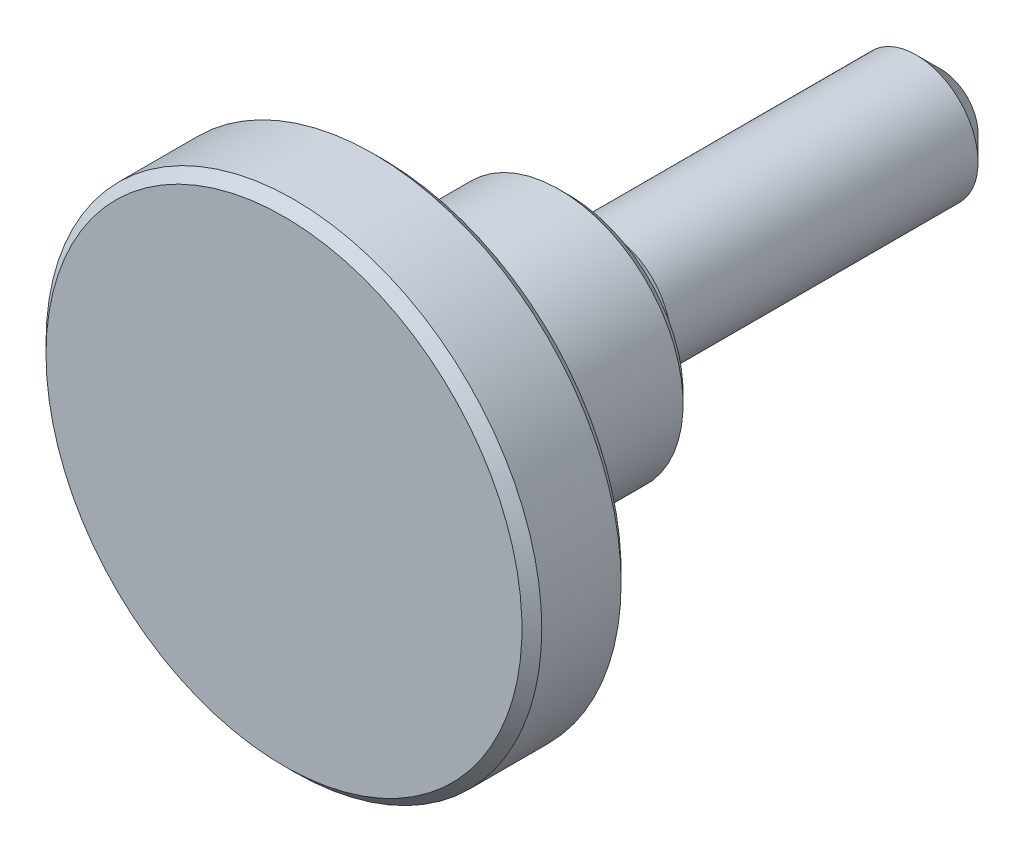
ISO-10303-21;
HEADER;
FILE_DESCRIPTION(('STEP AP214'),'2;1');
FILE_NAME('part.step','',(''),(''),'','','');
FILE_SCHEMA(('AUTOMOTIVE_DESIGN { 1 0 10303 214 1 1 1 1 }'));
ENDSEC;
DATA;
#1=APPLICATION_CONTEXT('core data for automotive mechanical design processes');
#2=APPLICATION_PROTOCOL_DEFINITION('international standard','automotive_design',2000,#1);
#3=PRODUCT_CONTEXT('',#1,'mechanical');
#4=PRODUCT('Part','Part','',(#3));
#5=PRODUCT_RELATED_PRODUCT_CATEGORY('part','',(#4));
#6=PRODUCT_DEFINITION_FORMATION('','',#4);
#7=PRODUCT_DEFINITION_CONTEXT('part definition',#1,'design');
#8=PRODUCT_DEFINITION('design','',#6,#7);
#9=PRODUCT_DEFINITION_SHAPE('','',#8);
#10=(LENGTH_UNIT() NAMED_UNIT(*) SI_UNIT(.MILLI.,.METRE.));
#11=(NAMED_UNIT(*) PLANE_ANGLE_UNIT() SI_UNIT($,.RADIAN.));
#12=(NAMED_UNIT(*) SI_UNIT($,.STERADIAN.) SOLID_ANGLE_UNIT());
#13=UNCERTAINTY_MEASURE_WITH_UNIT(LENGTH_MEASURE(1.E-05),#10,'distance_accuracy_value','');
#14=(GEOMETRIC_REPRESENTATION_CONTEXT(3) GLOBAL_UNCERTAINTY_ASSIGNED_CONTEXT((#13)) GLOBAL_UNIT_ASSIGNED_CONTEXT((#10,
#11,#12)) REPRESENTATION_CONTEXT('',''));
#15=CARTESIAN_POINT('',(0.,0.,0.));
#16=DIRECTION('',(0.,0.,1.));
#17=DIRECTION('',(1.,0.,0.));
#18=AXIS2_PLACEMENT_3D('',#15,#16,#17);
#19=CARTESIAN_POINT('',(0.,1.5,-15.));
#20=DIRECTION('',(0.,0.,-1.));
#21=DIRECTION('',(-1.,0.,0.));
#22=AXIS2_PLACEMENT_3D('',#19,#20,#21);
#23=PLANE('',#22);
#24=CARTESIAN_POINT('',(0.,0.,-15.));
#25=DIRECTION('',(0.,0.,-1.));
#26=DIRECTION('',(-1.,0.,0.));
#27=AXIS2_PLACEMENT_3D('',#24,#25,#26);
#28=CIRCLE('',#27,1.5);
#29=CARTESIAN_POINT('',(-1.5,0.,-15.));
#30=VERTEX_POINT('',#29);
#31=EDGE_CURVE('E8',#30,#30,#28,.T.);
#32=ORIENTED_EDGE('',*,*,#31,.T.);
#33=EDGE_LOOP('',(#32));
#34=FACE_BOUND('',#33,.T.);
#35=ADVANCED_FACE('F12',(#34),#23,.T.);
#36=CARTESIAN_POINT('',(0.,0.,-15.));
#37=DIRECTION('',(0.,0.,1.));
#38=DIRECTION('',(1.,0.,0.));
#39=AXIS2_PLACEMENT_3D('',#36,#37,#38);
#40=CONICAL_SURFACE('',#39,1.5,0.785398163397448);
#41=CARTESIAN_POINT('',(0.,0.,-14.));
#42=DIRECTION('',(0.,0.,-1.));
#43=DIRECTION('',(-1.,0.,0.));
#44=AXIS2_PLACEMENT_3D('',#41,#42,#43);
#45=CIRCLE('',#44,2.5);
#46=CARTESIAN_POINT('',(-2.5,0.,-14.));
#47=VERTEX_POINT('',#46);
#48=EDGE_CURVE('E18',#47,#47,#45,.T.);
#49=ORIENTED_EDGE('',*,*,#48,.T.);
#50=EDGE_LOOP('',(#49));
#51=FACE_BOUND('',#50,.T.);
#52=ORIENTED_EDGE('',*,*,#31,.F.);
#53=EDGE_LOOP('',(#52));
#54=FACE_BOUND('',#53,.T.);
#55=ADVANCED_FACE('F79',(#51,#54),#40,.T.);
#56=CARTESIAN_POINT('',(0.,0.,-17.5));
#57=DIRECTION('',(0.,0.,-1.));
#58=DIRECTION('',(-1.,0.,0.));
#59=AXIS2_PLACEMENT_3D('',#56,#57,#58);
#60=CYLINDRICAL_SURFACE('',#59,2.5);
#61=CARTESIAN_POINT('',(0.,0.,-1.6));
#62=DIRECTION('',(0.,0.,-1.));
#63=DIRECTION('',(-1.,0.,0.));
#64=AXIS2_PLACEMENT_3D('',#61,#62,#63);
#65=CIRCLE('',#64,2.5);
#66=CARTESIAN_POINT('',(-2.5,0.,-1.6));
#67=VERTEX_POINT('',#66);
#68=EDGE_CURVE('E22',#67,#67,#65,.T.);
#69=ORIENTED_EDGE('',*,*,#68,.T.);
#70=EDGE_LOOP('',(#69));
#71=FACE_BOUND('',#70,.T.);
#72=ORIENTED_EDGE('',*,*,#48,.F.);
#73=EDGE_LOOP('',(#72));
#74=FACE_BOUND('',#73,.T.);
#75=ADVANCED_FACE('F84',(#71,#74),#60,.T.);
#76=CARTESIAN_POINT('',(0.,2.25,-1.6));
#77=DIRECTION('',(0.,0.,1.));
#78=DIRECTION('',(1.,0.,0.));
#79=AXIS2_PLACEMENT_3D('',#76,#77,#78);
#80=PLANE('',#79);
#81=CARTESIAN_POINT('',(0.,0.,-1.6));
#82=DIRECTION('',(0.,0.,-1.));
#83=DIRECTION('',(-1.,0.,0.));
#84=AXIS2_PLACEMENT_3D('',#81,#82,#83);
#85=CIRCLE('',#84,2.25);
#86=CARTESIAN_POINT('',(-2.25,0.,-1.6));
#87=VERTEX_POINT('',#86);
#88=EDGE_CURVE('E26',#87,#87,#85,.T.);
#89=ORIENTED_EDGE('',*,*,#88,.T.);
#90=EDGE_LOOP('',(#89));
#91=FACE_BOUND('',#90,.T.);
#92=ORIENTED_EDGE('',*,*,#68,.F.);
#93=EDGE_LOOP('',(#92));
#94=FACE_BOUND('',#93,.T.);
#95=ADVANCED_FACE('F89',(#91,#94),#80,.T.);
#96=CARTESIAN_POINT('',(0.,0.,-1.2));
#97=DIRECTION('',(0.,0.,-1.));
#98=DIRECTION('',(-1.,0.,0.));
#99=AXIS2_PLACEMENT_3D('',#96,#97,#98);
#100=TOROIDAL_SURFACE('',#99,2.25,0.4);
#101=CARTESIAN_POINT('',(0.,0.,-1.2));
#102=DIRECTION('',(0.,0.,-1.));
#103=DIRECTION('',(-1.,0.,0.));
#104=AXIS2_PLACEMENT_3D('',#101,#102,#103);
#105=CIRCLE('',#104,1.85);
#106=CARTESIAN_POINT('',(-1.85,0.,-1.2));
#107=VERTEX_POINT('',#106);
#108=EDGE_CURVE('E31',#107,#107,#105,.T.);
#109=ORIENTED_EDGE('',*,*,#108,.T.);
#110=EDGE_LOOP('',(#109));
#111=FACE_BOUND('',#110,.T.);
#112=ORIENTED_EDGE('',*,*,#88,.F.);
#113=EDGE_LOOP('',(#112));
#114=FACE_BOUND('',#113,.T.);
#115=ADVANCED_FACE('F96',(#111,#114),#100,.F.);
#116=CARTESIAN_POINT('',(0.,0.,-17.5));
#117=DIRECTION('',(0.,0.,-1.));
#118=DIRECTION('',(-1.,0.,0.));
#119=AXIS2_PLACEMENT_3D('',#116,#117,#118);
#120=CYLINDRICAL_SURFACE('',#119,1.85);
#121=CARTESIAN_POINT('',(0.,0.,-0.400000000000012));
#122=DIRECTION('',(0.,0.,-1.));
#123=DIRECTION('',(-1.,0.,0.));
#124=AXIS2_PLACEMENT_3D('',#121,#122,#123);
#125=CIRCLE('',#124,1.85);
#126=CARTESIAN_POINT('',(-1.85,0.,-0.400000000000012));
#127=VERTEX_POINT('',#126);
#128=EDGE_CURVE('E34',#127,#127,#125,.T.);
#129=ORIENTED_EDGE('',*,*,#128,.T.);
#130=EDGE_LOOP('',(#129));
#131=FACE_BOUND('',#130,.T.);
#132=ORIENTED_EDGE('',*,*,#108,.F.);
#133=EDGE_LOOP('',(#132));
#134=FACE_BOUND('',#133,.T.);
#135=ADVANCED_FACE('F100',(#131,#134),#120,.T.);
#136=CARTESIAN_POINT('',(0.,0.,-0.400000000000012));
#137=DIRECTION('',(0.,0.,-1.));
#138=DIRECTION('',(-1.,0.,0.));
#139=AXIS2_PLACEMENT_3D('',#136,#137,#138);
#140=TOROIDAL_SURFACE('',#139,2.25,0.400000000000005);
#141=CARTESIAN_POINT('',(0.,0.,0.));
#142=DIRECTION('',(0.,0.,-1.));
#143=DIRECTION('',(-1.,0.,0.));
#144=AXIS2_PLACEMENT_3D('',#141,#142,#143);
#145=CIRCLE('',#144,2.25);
#146=CARTESIAN_POINT('',(-2.25,0.,0.));
#147=VERTEX_POINT('',#146);
#148=EDGE_CURVE('E37',#147,#147,#145,.T.);
#149=ORIENTED_EDGE('',*,*,#148,.T.);
#150=EDGE_LOOP('',(#149));
#151=FACE_BOUND('',#150,.T.);
#152=ORIENTED_EDGE('',*,*,#128,.F.);
#153=EDGE_LOOP('',(#152));
#154=FACE_BOUND('',#153,.T.);
#155=ADVANCED_FACE('F104',(#151,#154),#140,.F.);
#156=CARTESIAN_POINT('',(0.,4.6,0.));
#157=DIRECTION('',(0.,0.,-1.));
#158=DIRECTION('',(-1.,0.,0.));
#159=AXIS2_PLACEMENT_3D('',#156,#157,#158);
#160=PLANE('',#159);
#161=CARTESIAN_POINT('',(0.,0.,0.));
#162=DIRECTION('',(0.,0.,-1.));
#163=DIRECTION('',(-1.,0.,0.));
#164=AXIS2_PLACEMENT_3D('',#161,#162,#163);
#165=CIRCLE('',#164,4.6);
#166=CARTESIAN_POINT('',(-4.6,0.,0.));
#167=VERTEX_POINT('',#166);
#168=EDGE_CURVE('E40',#167,#167,#165,.T.);
#169=ORIENTED_EDGE('',*,*,#168,.T.);
#170=EDGE_LOOP('',(#169));
#171=FACE_BOUND('',#170,.T.);
#172=ORIENTED_EDGE('',*,*,#148,.F.);
#173=EDGE_LOOP('',(#172));
#174=FACE_BOUND('',#173,.T.);
#175=ADVANCED_FACE('F108',(#171,#174),#160,.T.);
#176=CARTESIAN_POINT('',(0.,0.,0.));
#177=DIRECTION('',(0.,0.,1.));
#178=DIRECTION('',(1.,0.,0.));
#179=AXIS2_PLACEMENT_3D('',#176,#177,#178);
#180=CONICAL_SURFACE('',#179,4.6,0.785398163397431);
#181=CARTESIAN_POINT('',(0.,0.,0.400000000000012));
#182=DIRECTION('',(0.,0.,-1.));
#183=DIRECTION('',(-1.,0.,0.));
#184=AXIS2_PLACEMENT_3D('',#181,#182,#183);
#185=CIRCLE('',#184,5.);
#186=CARTESIAN_POINT('',(-5.,0.,0.400000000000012));
#187=VERTEX_POINT('',#186);
#188=EDGE_CURVE('E43',#187,#187,#185,.T.);
#189=ORIENTED_EDGE('',*,*,#188,.T.);
#190=EDGE_LOOP('',(#189));
#191=FACE_BOUND('',#190,.T.);
#192=ORIENTED_EDGE('',*,*,#168,.F.);
#193=EDGE_LOOP('',(#192));
#194=FACE_BOUND('',#193,.T.);
#195=ADVANCED_FACE('F112',(#191,#194),#180,.T.);
#196=CARTESIAN_POINT('',(0.,0.,-17.5));
#197=DIRECTION('',(0.,0.,-1.));
#198=DIRECTION('',(-1.,0.,0.));
#199=AXIS2_PLACEMENT_3D('',#196,#197,#198);
#200=CYLINDRICAL_SURFACE('',#199,5.);
#201=CARTESIAN_POINT('',(0.,0.,6.5));
#202=DIRECTION('',(0.,0.,-1.));
#203=DIRECTION('',(-1.,0.,0.));
#204=AXIS2_PLACEMENT_3D('',#201,#202,#203);
#205=CIRCLE('',#204,5.);
#206=CARTESIAN_POINT('',(-5.,0.,6.5));
#207=VERTEX_POINT('',#206);
#208=EDGE_CURVE('E46',#207,#207,#205,.T.);
#209=ORIENTED_EDGE('',*,*,#208,.T.);
#210=EDGE_LOOP('',(#209));
#211=FACE_BOUND('',#210,.T.);
#212=ORIENTED_EDGE('',*,*,#188,.F.);
#213=EDGE_LOOP('',(#212));
#214=FACE_BOUND('',#213,.T.);
#215=ADVANCED_FACE('F116',(#211,#214),#200,.T.);
#216=CARTESIAN_POINT('',(0.,0.,6.5));
#217=DIRECTION('',(0.,0.,-1.));
#218=DIRECTION('',(-1.,0.,0.));
#219=AXIS2_PLACEMENT_3D('',#216,#217,#218);
#220=TOROIDAL_SURFACE('',#219,6.,1.);
#221=CARTESIAN_POINT('',(0.,0.,7.5));
#222=DIRECTION('',(0.,0.,-1.));
#223=DIRECTION('',(-1.,0.,0.));
#224=AXIS2_PLACEMENT_3D('',#221,#222,#223);
#225=CIRCLE('',#224,6.);
#226=CARTESIAN_POINT('',(-6.,0.,7.5));
#227=VERTEX_POINT('',#226);
#228=EDGE_CURVE('E49',#227,#227,#225,.T.);
#229=ORIENTED_EDGE('',*,*,#228,.T.);
#230=EDGE_LOOP('',(#229));
#231=FACE_BOUND('',#230,.T.);
#232=ORIENTED_EDGE('',*,*,#208,.F.);
#233=EDGE_LOOP('',(#232));
#234=FACE_BOUND('',#233,.T.);
#235=ADVANCED_FACE('F120',(#231,#234),#220,.F.);
#236=CARTESIAN_POINT('',(0.,9.6,7.5));
#237=DIRECTION('',(0.,0.,-1.));
#238=DIRECTION('',(-1.,0.,0.));
#239=AXIS2_PLACEMENT_3D('',#236,#237,#238);
#240=PLANE('',#239);
#241=CARTESIAN_POINT('',(0.,0.,7.5));
#242=DIRECTION('',(0.,0.,-1.));
#243=DIRECTION('',(-1.,0.,0.));
#244=AXIS2_PLACEMENT_3D('',#241,#242,#243);
#245=CIRCLE('',#244,9.6);
#246=CARTESIAN_POINT('',(-9.6,0.,7.5));
#247=VERTEX_POINT('',#246);
#248=EDGE_CURVE('E52',#247,#247,#245,.T.);
#249=ORIENTED_EDGE('',*,*,#248,.T.);
#250=EDGE_LOOP('',(#249));
#251=FACE_BOUND('',#250,.T.);
#252=ORIENTED_EDGE('',*,*,#228,.F.);
#253=EDGE_LOOP('',(#252));
#254=FACE_BOUND('',#253,.T.);
#255=ADVANCED_FACE('F124',(#251,#254),#240,.T.);
#256=CARTESIAN_POINT('',(0.,0.,7.5));
#257=DIRECTION('',(0.,0.,1.));
#258=DIRECTION('',(1.,0.,0.));
#259=AXIS2_PLACEMENT_3D('',#256,#257,#258);
#260=CONICAL_SURFACE('',#259,9.6,0.785398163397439);
#261=CARTESIAN_POINT('',(0.,0.,7.9));
#262=DIRECTION('',(0.,0.,-1.));
#263=DIRECTION('',(-1.,0.,0.));
#264=AXIS2_PLACEMENT_3D('',#261,#262,#263);
#265=CIRCLE('',#264,10.);
#266=CARTESIAN_POINT('',(-10.,0.,7.9));
#267=VERTEX_POINT('',#266);
#268=EDGE_CURVE('E55',#267,#267,#265,.T.);
#269=ORIENTED_EDGE('',*,*,#268,.T.);
#270=EDGE_LOOP('',(#269));
#271=FACE_BOUND('',#270,.T.);
#272=ORIENTED_EDGE('',*,*,#248,.F.);
#273=EDGE_LOOP('',(#272));
#274=FACE_BOUND('',#273,.T.);
#275=ADVANCED_FACE('F128',(#271,#274),#260,.T.);
#276=CARTESIAN_POINT('',(0.,0.,-17.5));
#277=DIRECTION('',(0.,0.,-1.));
#278=DIRECTION('',(-1.,0.,0.));
#279=AXIS2_PLACEMENT_3D('',#276,#277,#278);
#280=CYLINDRICAL_SURFACE('',#279,10.);
#281=CARTESIAN_POINT('',(0.,0.,11.1));
#282=DIRECTION('',(0.,0.,-1.));
#283=DIRECTION('',(-1.,0.,0.));
#284=AXIS2_PLACEMENT_3D('',#281,#282,#283);
#285=CIRCLE('',#284,10.);
#286=CARTESIAN_POINT('',(-10.,0.,11.1));
#287=VERTEX_POINT('',#286);
#288=EDGE_CURVE('E58',#287,#287,#285,.T.);
#289=ORIENTED_EDGE('',*,*,#288,.T.);
#290=EDGE_LOOP('',(#289));
#291=FACE_BOUND('',#290,.T.);
#292=ORIENTED_EDGE('',*,*,#268,.F.);
#293=EDGE_LOOP('',(#292));
#294=FACE_BOUND('',#293,.T.);
#295=ADVANCED_FACE('F76',(#291,#294),#280,.T.);
#296=CARTESIAN_POINT('',(0.,0.,11.1));
#297=DIRECTION('',(0.,0.,-1.));
#298=DIRECTION('',(-1.,0.,0.));
#299=AXIS2_PLACEMENT_3D('',#296,#297,#298);
#300=CONICAL_SURFACE('',#299,10.,0.785398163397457);
#301=CARTESIAN_POINT('',(0.,0.,11.5));
#302=DIRECTION('',(0.,0.,-1.));
#303=DIRECTION('',(-1.,0.,0.));
#304=AXIS2_PLACEMENT_3D('',#301,#302,#303);
#305=CIRCLE('',#304,9.6);
#306=CARTESIAN_POINT('',(-9.6,0.,11.5));
#307=VERTEX_POINT('',#306);
#308=EDGE_CURVE('E61',#307,#307,#305,.T.);
#309=ORIENTED_EDGE('',*,*,#308,.T.);
#310=EDGE_LOOP('',(#309));
#311=FACE_BOUND('',#310,.T.);
#312=ORIENTED_EDGE('',*,*,#288,.F.);
#313=EDGE_LOOP('',(#312));
#314=FACE_BOUND('',#313,.T.);
#315=ADVANCED_FACE('F65',(#311,#314),#300,.T.);
#316=CARTESIAN_POINT('',(0.,9.6,11.5));
#317=DIRECTION('',(0.,0.,1.));
#318=DIRECTION('',(1.,0.,0.));
#319=AXIS2_PLACEMENT_3D('',#316,#317,#318);
#320=PLANE('',#319);
#321=ORIENTED_EDGE('',*,*,#308,.F.);
#322=EDGE_LOOP('',(#321));
#323=FACE_BOUND('',#322,.T.);
#324=ADVANCED_FACE('F68',(#323),#320,.T.);
#325=CLOSED_SHELL('',(#35,#55,#75,#95,#115,#135,#155,#175,#195,#215,#235,#255,#275,#295,#315,#324));
#326=MANIFOLD_SOLID_BREP('B1',#325);
#327=ADVANCED_BREP_SHAPE_REPRESENTATION('',(#18,#326),#14);
#328=SHAPE_DEFINITION_REPRESENTATION(#9,#327);
ENDSEC;
END-ISO-10303-21;
